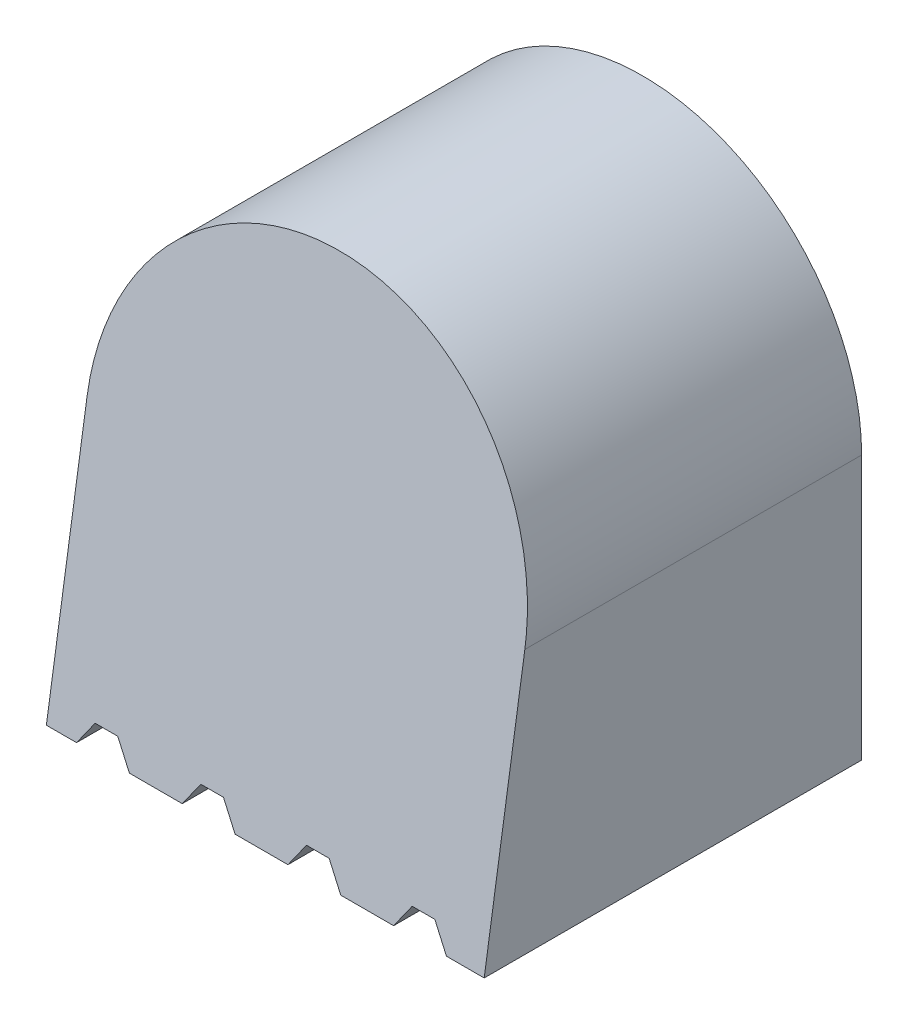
from build123d import *

# Parameters (mm, degrees)
BASE_EXTRUSION_DEPTH    = 50
ENL_V_MAT_EXTRU_1_DEPTH = 100.799799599
ENL_V_MAT_EXTRU_2_DEPTH = 100.799799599
ESQUISSE4_R             = 25.5
ENL_V_MAT_EXTRU_3_DEPTH = 35
ENL_V_MAT_EXTRU_4_DEPTH = 43


with BuildPart() as part:
    # Esquisse1 → Base-Extrusion (new body)
    with BuildSketch(Plane.XY):
        with BuildLine():
            Line((0, 0), (58, 0))
            Line((58, 0), (58, 35))
            ThreePointArc((58, 35), (29, 64), (0, 35))
            Line((0, 35), (0, 0))
        make_face()
    extrude(amount=BASE_EXTRUSION_DEPTH)

    # Esquisse2 → Enl_v. mat.-Extru.1 (cut, through all)
    with BuildSketch(Plane(origin=(58, 0, 0), x_dir=(0, 0, -1), z_dir=(1, 0, 0))):
        Polygon((-50, 0), (-40, 65), (-55, 65), (-55, 0), align=None)
    extrude(amount=-ENL_V_MAT_EXTRU_1_DEPTH, mode=Mode.SUBTRACT)

    # Esquisse3 → Enl_v. mat.-Extru.2 (cut, through all)
    with BuildSketch(Plane(origin=(0, 0, 0), x_dir=(-1, 0, 0), z_dir=(0, 0, -1))):
        Polygon((-53, 0), (-51, 3), (-48, 3), (-46, 0), align=None)
        Polygon((-39, 0), (-32, 0), (-34, 3), (-37, 3), align=None)
        Polygon((-25, 0), (-18, 0), (-20, 3), (-23, 3), align=None)
        Polygon((-11, 0), (-4, 0), (-6, 3), (-9, 3), align=None)
    extrude(amount=-ENL_V_MAT_EXTRU_2_DEPTH, mode=Mode.SUBTRACT)

    # Esquisse4 → Enl_v. mat.-Extru.3 (cut)
    with BuildSketch(Plane(origin=(0, 0, 0), x_dir=(-1, 0, 0), z_dir=(0, 0, -1))):
        with Locations((-29, 35)):
            Circle(ESQUISSE4_R)
    extrude(amount=-ENL_V_MAT_EXTRU_3_DEPTH, mode=Mode.SUBTRACT)

    # Esquisse5 → Enl_v. mat.-Extru.4 (cut)
    with BuildSketch(Plane(origin=(0, 0, 0), x_dir=(-1, 0, 0), z_dir=(0, 0, -1))):
        with BuildLine():
            Line((-51.107690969, 19.5), (-54.900963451, 19.5))
            Line((-54.900963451, 19.5), (-54.900963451, 5.5))
            Line((-54.900963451, 5.5), (-49.900963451, 5.5))
            Line((-49.900963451, 5.5), (-49.900963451, 17.907612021))
            ThreePointArc((-49.900963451, 17.907612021), (-50.519061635, 18.692640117), (-51.107690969, 19.5))
        make_face()
        with BuildLine():
            Line((-45.900963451, 13.943945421), (-45.900963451, 5.5))
            Line((-45.900963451, 5.5), (-40.900963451, 5.5))
            Line((-40.900963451, 5.5), (-40.900963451, 10.764343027))
            ThreePointArc((-40.900963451, 10.764343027), (-43.488451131, 12.216567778), (-45.900963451, 13.943945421))
        make_face()
        with BuildLine():
            Line((-3.099036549, 5.5), (-8.099036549, 5.5))
            Line((-8.099036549, 5.5), (-8.099036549, 17.907612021))
            ThreePointArc((-8.099036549, 17.907612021), (-7.480938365, 18.692640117), (-6.892309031, 19.5))
            Line((-6.892309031, 19.5), (-3.099036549, 19.5))
            Line((-3.099036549, 19.5), (-3.099036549, 5.5))
        make_face()
        with BuildLine():
            Line((-17.099036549, 5.5), (-17.099036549, 10.764343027))
            ThreePointArc((-17.099036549, 10.764343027), (-14.511548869, 12.216567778), (-12.099036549, 13.943945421))
            Line((-12.099036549, 13.943945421), (-12.099036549, 5.5))
            Line((-12.099036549, 5.5), (-17.099036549, 5.5))
        make_face()
    extrude(amount=-ENL_V_MAT_EXTRU_4_DEPTH, mode=Mode.SUBTRACT)


solid = part.part
